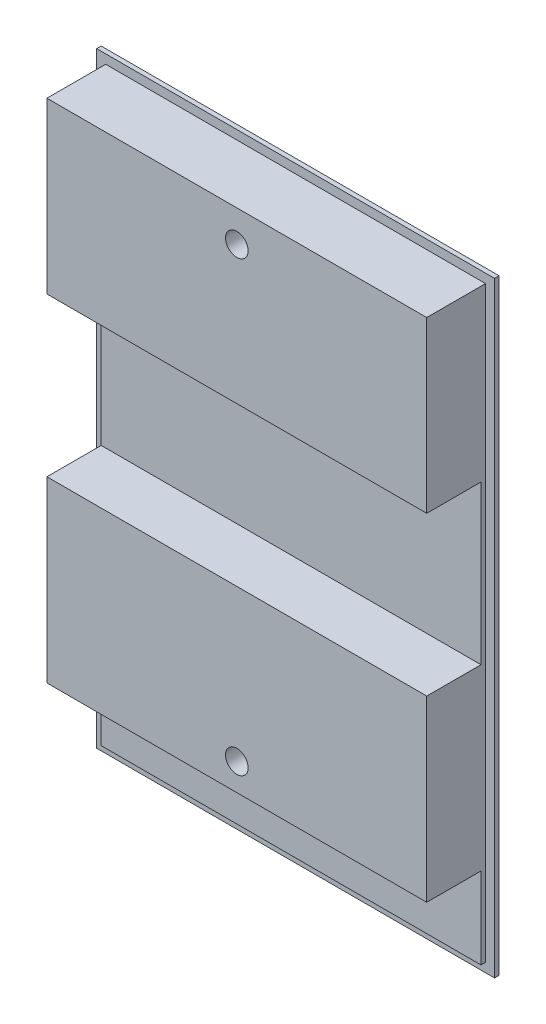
ISO-10303-21;
HEADER;
FILE_DESCRIPTION(('STEP AP214'),'2;1');
FILE_NAME('part.step','',(''),(''),'','','');
FILE_SCHEMA(('AUTOMOTIVE_DESIGN { 1 0 10303 214 1 1 1 1 }'));
ENDSEC;
DATA;
#1=APPLICATION_CONTEXT('core data for automotive mechanical design processes');
#2=APPLICATION_PROTOCOL_DEFINITION('international standard','automotive_design',2000,#1);
#3=PRODUCT_CONTEXT('',#1,'mechanical');
#4=PRODUCT('Part','Part','',(#3));
#5=PRODUCT_RELATED_PRODUCT_CATEGORY('part','',(#4));
#6=PRODUCT_DEFINITION_FORMATION('','',#4);
#7=PRODUCT_DEFINITION_CONTEXT('part definition',#1,'design');
#8=PRODUCT_DEFINITION('design','',#6,#7);
#9=PRODUCT_DEFINITION_SHAPE('','',#8);
#10=(LENGTH_UNIT() NAMED_UNIT(*) SI_UNIT(.MILLI.,.METRE.));
#11=(NAMED_UNIT(*) PLANE_ANGLE_UNIT() SI_UNIT($,.RADIAN.));
#12=(NAMED_UNIT(*) SI_UNIT($,.STERADIAN.) SOLID_ANGLE_UNIT());
#13=UNCERTAINTY_MEASURE_WITH_UNIT(LENGTH_MEASURE(1.E-05),#10,'distance_accuracy_value','');
#14=(GEOMETRIC_REPRESENTATION_CONTEXT(3) GLOBAL_UNCERTAINTY_ASSIGNED_CONTEXT((#13)) GLOBAL_UNIT_ASSIGNED_CONTEXT((#10,
#11,#12)) REPRESENTATION_CONTEXT('',''));
#15=CARTESIAN_POINT('',(0.,0.,0.));
#16=DIRECTION('',(0.,0.,1.));
#17=DIRECTION('',(1.,0.,0.));
#18=AXIS2_PLACEMENT_3D('',#15,#16,#17);
#19=CARTESIAN_POINT('',(0.,0.,2.));
#20=DIRECTION('',(0.,0.,-1.));
#21=DIRECTION('',(-1.,0.,0.));
#22=AXIS2_PLACEMENT_3D('',#19,#20,#21);
#23=PLANE('',#22);
#24=DIRECTION('',(1.,0.,0.));
#25=VECTOR('',#24,1.);
#26=CARTESIAN_POINT('',(0.,-47.,2.));
#27=LINE('',#26,#25);
#28=CARTESIAN_POINT('',(-42.,-47.,2.));
#29=VERTEX_POINT('',#28);
#30=CARTESIAN_POINT('',(42.,-47.,2.));
#31=VERTEX_POINT('',#30);
#32=EDGE_CURVE('E195',#29,#31,#27,.T.);
#33=ORIENTED_EDGE('',*,*,#32,.F.);
#34=DIRECTION('',(0.,-1.,0.));
#35=VECTOR('',#34,1.);
#36=CARTESIAN_POINT('',(-42.,-65.,2.));
#37=LINE('',#36,#35);
#38=CARTESIAN_POINT('',(-42.,-65.,2.));
#39=VERTEX_POINT('',#38);
#40=EDGE_CURVE('E252',#29,#39,#37,.T.);
#41=ORIENTED_EDGE('',*,*,#40,.T.);
#42=DIRECTION('',(1.,0.,0.));
#43=VECTOR('',#42,1.);
#44=CARTESIAN_POINT('',(-42.,-65.,2.));
#45=LINE('',#44,#43);
#46=CARTESIAN_POINT('',(42.,-65.,2.));
#47=VERTEX_POINT('',#46);
#48=EDGE_CURVE('E255',#39,#47,#45,.T.);
#49=ORIENTED_EDGE('',*,*,#48,.T.);
#50=DIRECTION('',(0.,1.,0.));
#51=VECTOR('',#50,1.);
#52=CARTESIAN_POINT('',(42.,-65.,2.));
#53=LINE('',#52,#51);
#54=EDGE_CURVE('E250',#47,#31,#53,.T.);
#55=ORIENTED_EDGE('',*,*,#54,.T.);
#56=EDGE_LOOP('',(#33,#41,#49,#55));
#57=FACE_BOUND('',#56,.T.);
#58=ADVANCED_FACE('F41',(#57),#23,.F.);
#59=CARTESIAN_POINT('',(-42.,27.5,2.));
#60=VERTEX_POINT('',#59);
#61=CARTESIAN_POINT('',(-42.,-7.50000000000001,2.));
#62=VERTEX_POINT('',#61);
#63=EDGE_CURVE('E253',#60,#62,#37,.T.);
#64=ORIENTED_EDGE('',*,*,#63,.T.);
#65=DIRECTION('',(1.,0.,0.));
#66=VECTOR('',#65,1.);
#67=CARTESIAN_POINT('',(0.,-7.50000000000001,2.));
#68=LINE('',#67,#66);
#69=CARTESIAN_POINT('',(42.,-7.50000000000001,2.));
#70=VERTEX_POINT('',#69);
#71=EDGE_CURVE('E63',#62,#70,#68,.T.);
#72=ORIENTED_EDGE('',*,*,#71,.T.);
#73=CARTESIAN_POINT('',(42.,27.5,2.));
#74=VERTEX_POINT('',#73);
#75=EDGE_CURVE('E249',#70,#74,#53,.T.);
#76=ORIENTED_EDGE('',*,*,#75,.T.);
#77=DIRECTION('',(1.,0.,0.));
#78=VECTOR('',#77,1.);
#79=CARTESIAN_POINT('',(0.,27.5,2.));
#80=LINE('',#79,#78);
#81=EDGE_CURVE('E228',#60,#74,#80,.T.);
#82=ORIENTED_EDGE('',*,*,#81,.F.);
#83=EDGE_LOOP('',(#64,#72,#76,#82));
#84=FACE_BOUND('',#83,.T.);
#85=ADVANCED_FACE('F300',(#84),#23,.F.);
#86=CARTESIAN_POINT('',(42.,-65.,2.));
#87=DIRECTION('',(-1.,0.,0.));
#88=DIRECTION('',(0.,0.,1.));
#89=AXIS2_PLACEMENT_3D('',#86,#87,#88);
#90=PLANE('',#89);
#91=DIRECTION('',(0.,0.,-1.));
#92=VECTOR('',#91,1.);
#93=CARTESIAN_POINT('',(42.,-65.,2.));
#94=LINE('',#93,#92);
#95=CARTESIAN_POINT('',(42.,-65.,1.));
#96=VERTEX_POINT('',#95);
#97=EDGE_CURVE('E257',#47,#96,#94,.T.);
#98=ORIENTED_EDGE('',*,*,#97,.T.);
#99=DIRECTION('',(0.,1.,0.));
#100=VECTOR('',#99,1.);
#101=CARTESIAN_POINT('',(42.,-65.,1.));
#102=LINE('',#101,#100);
#103=CARTESIAN_POINT('',(42.,65.,1.));
#104=VERTEX_POINT('',#103);
#105=EDGE_CURVE('E56',#96,#104,#102,.T.);
#106=ORIENTED_EDGE('',*,*,#105,.T.);
#107=DIRECTION('',(0.,0.,-1.));
#108=VECTOR('',#107,1.);
#109=CARTESIAN_POINT('',(42.,65.,2.));
#110=LINE('',#109,#108);
#111=CARTESIAN_POINT('',(42.,65.,14.));
#112=VERTEX_POINT('',#111);
#113=EDGE_CURVE('E49',#112,#104,#110,.T.);
#114=ORIENTED_EDGE('',*,*,#113,.F.);
#115=DIRECTION('',(0.,1.,0.));
#116=VECTOR('',#115,1.);
#117=CARTESIAN_POINT('',(42.,0.,14.));
#118=LINE('',#117,#116);
#119=CARTESIAN_POINT('',(42.,27.5,14.));
#120=VERTEX_POINT('',#119);
#121=EDGE_CURVE('E233',#120,#112,#118,.T.);
#122=ORIENTED_EDGE('',*,*,#121,.F.);
#123=DIRECTION('',(0.,0.,-1.));
#124=VECTOR('',#123,1.);
#125=CARTESIAN_POINT('',(42.,27.5,14.));
#126=LINE('',#125,#124);
#127=EDGE_CURVE('E239',#120,#74,#126,.T.);
#128=ORIENTED_EDGE('',*,*,#127,.T.);
#129=ORIENTED_EDGE('',*,*,#75,.F.);
#130=DIRECTION('',(0.,0.,-1.));
#131=VECTOR('',#130,1.);
#132=CARTESIAN_POINT('',(42.,-7.50000000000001,14.));
#133=LINE('',#132,#131);
#134=CARTESIAN_POINT('',(42.,-7.50000000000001,14.));
#135=VERTEX_POINT('',#134);
#136=EDGE_CURVE('E206',#135,#70,#133,.T.);
#137=ORIENTED_EDGE('',*,*,#136,.F.);
#138=DIRECTION('',(0.,1.,0.));
#139=VECTOR('',#138,1.);
#140=CARTESIAN_POINT('',(42.,0.,14.));
#141=LINE('',#140,#139);
#142=CARTESIAN_POINT('',(42.,-47.,14.));
#143=VERTEX_POINT('',#142);
#144=EDGE_CURVE('E204',#143,#135,#141,.T.);
#145=ORIENTED_EDGE('',*,*,#144,.F.);
#146=DIRECTION('',(0.,0.,-1.));
#147=VECTOR('',#146,1.);
#148=CARTESIAN_POINT('',(42.,-47.,14.));
#149=LINE('',#148,#147);
#150=EDGE_CURVE('E214',#143,#31,#149,.T.);
#151=ORIENTED_EDGE('',*,*,#150,.T.);
#152=ORIENTED_EDGE('',*,*,#54,.F.);
#153=EDGE_LOOP('',(#98,#106,#114,#122,#128,#129,#137,#145,#151,#152));
#154=FACE_BOUND('',#153,.T.);
#155=ADVANCED_FACE('F43',(#154),#90,.F.);
#156=CARTESIAN_POINT('',(-42.,65.,2.));
#157=DIRECTION('',(0.,-1.,0.));
#158=DIRECTION('',(0.,0.,-1.));
#159=AXIS2_PLACEMENT_3D('',#156,#157,#158);
#160=PLANE('',#159);
#161=ORIENTED_EDGE('',*,*,#113,.T.);
#162=DIRECTION('',(-1.,0.,0.));
#163=VECTOR('',#162,1.);
#164=CARTESIAN_POINT('',(-42.,65.,1.));
#165=LINE('',#164,#163);
#166=CARTESIAN_POINT('',(-42.,65.,1.));
#167=VERTEX_POINT('',#166);
#168=EDGE_CURVE('E186',#104,#167,#165,.T.);
#169=ORIENTED_EDGE('',*,*,#168,.T.);
#170=DIRECTION('',(0.,0.,-1.));
#171=VECTOR('',#170,1.);
#172=CARTESIAN_POINT('',(-42.,65.,2.));
#173=LINE('',#172,#171);
#174=CARTESIAN_POINT('',(-42.,65.,14.));
#175=VERTEX_POINT('',#174);
#176=EDGE_CURVE('E263',#175,#167,#173,.T.);
#177=ORIENTED_EDGE('',*,*,#176,.F.);
#178=DIRECTION('',(-1.,0.,0.));
#179=VECTOR('',#178,1.);
#180=CARTESIAN_POINT('',(0.,65.,14.));
#181=LINE('',#180,#179);
#182=EDGE_CURVE('E236',#112,#175,#181,.T.);
#183=ORIENTED_EDGE('',*,*,#182,.F.);
#184=EDGE_LOOP('',(#161,#169,#177,#183));
#185=FACE_BOUND('',#184,.T.);
#186=ADVANCED_FACE('F268',(#185),#160,.F.);
#187=CARTESIAN_POINT('',(-42.,-65.,2.));
#188=DIRECTION('',(1.,0.,0.));
#189=DIRECTION('',(0.,0.,-1.));
#190=AXIS2_PLACEMENT_3D('',#187,#188,#189);
#191=PLANE('',#190);
#192=ORIENTED_EDGE('',*,*,#176,.T.);
#193=DIRECTION('',(0.,-1.,0.));
#194=VECTOR('',#193,1.);
#195=CARTESIAN_POINT('',(-42.,-65.,1.));
#196=LINE('',#195,#194);
#197=CARTESIAN_POINT('',(-42.,-65.,1.));
#198=VERTEX_POINT('',#197);
#199=EDGE_CURVE('E180',#167,#198,#196,.T.);
#200=ORIENTED_EDGE('',*,*,#199,.T.);
#201=DIRECTION('',(0.,0.,-1.));
#202=VECTOR('',#201,1.);
#203=CARTESIAN_POINT('',(-42.,-65.,2.));
#204=LINE('',#203,#202);
#205=EDGE_CURVE('E260',#39,#198,#204,.T.);
#206=ORIENTED_EDGE('',*,*,#205,.F.);
#207=ORIENTED_EDGE('',*,*,#40,.F.);
#208=DIRECTION('',(0.,0.,-1.));
#209=VECTOR('',#208,1.);
#210=CARTESIAN_POINT('',(-42.,-47.,14.));
#211=LINE('',#210,#209);
#212=CARTESIAN_POINT('',(-42.,-47.,14.));
#213=VERTEX_POINT('',#212);
#214=EDGE_CURVE('E217',#213,#29,#211,.T.);
#215=ORIENTED_EDGE('',*,*,#214,.F.);
#216=DIRECTION('',(0.,-1.,0.));
#217=VECTOR('',#216,1.);
#218=CARTESIAN_POINT('',(-42.,0.,14.));
#219=LINE('',#218,#217);
#220=CARTESIAN_POINT('',(-42.,-7.50000000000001,14.));
#221=VERTEX_POINT('',#220);
#222=EDGE_CURVE('E198',#221,#213,#219,.T.);
#223=ORIENTED_EDGE('',*,*,#222,.F.);
#224=DIRECTION('',(0.,0.,-1.));
#225=VECTOR('',#224,1.);
#226=CARTESIAN_POINT('',(-42.,-7.50000000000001,14.));
#227=LINE('',#226,#225);
#228=EDGE_CURVE('E220',#221,#62,#227,.T.);
#229=ORIENTED_EDGE('',*,*,#228,.T.);
#230=ORIENTED_EDGE('',*,*,#63,.F.);
#231=DIRECTION('',(0.,0.,-1.));
#232=VECTOR('',#231,1.);
#233=CARTESIAN_POINT('',(-42.,27.5,14.));
#234=LINE('',#233,#232);
#235=CARTESIAN_POINT('',(-42.,27.5,14.));
#236=VERTEX_POINT('',#235);
#237=EDGE_CURVE('E246',#236,#60,#234,.T.);
#238=ORIENTED_EDGE('',*,*,#237,.F.);
#239=DIRECTION('',(0.,-1.,0.));
#240=VECTOR('',#239,1.);
#241=CARTESIAN_POINT('',(-42.,0.,14.));
#242=LINE('',#241,#240);
#243=EDGE_CURVE('E227',#175,#236,#242,.T.);
#244=ORIENTED_EDGE('',*,*,#243,.F.);
#245=EDGE_LOOP('',(#192,#200,#206,#207,#215,#223,#229,#230,#238,#244));
#246=FACE_BOUND('',#245,.T.);
#247=ADVANCED_FACE('F298',(#246),#191,.F.);
#248=CARTESIAN_POINT('',(-42.,-65.,2.));
#249=DIRECTION('',(0.,1.,0.));
#250=DIRECTION('',(0.,0.,1.));
#251=AXIS2_PLACEMENT_3D('',#248,#249,#250);
#252=PLANE('',#251);
#253=ORIENTED_EDGE('',*,*,#205,.T.);
#254=DIRECTION('',(1.,0.,0.));
#255=VECTOR('',#254,1.);
#256=CARTESIAN_POINT('',(-42.,-65.,1.));
#257=LINE('',#256,#255);
#258=EDGE_CURVE('E11',#198,#96,#257,.T.);
#259=ORIENTED_EDGE('',*,*,#258,.T.);
#260=ORIENTED_EDGE('',*,*,#97,.F.);
#261=ORIENTED_EDGE('',*,*,#48,.F.);
#262=EDGE_LOOP('',(#253,#259,#260,#261));
#263=FACE_BOUND('',#262,.T.);
#264=ADVANCED_FACE('F296',(#263),#252,.F.);
#265=CARTESIAN_POINT('',(0.,27.5,14.));
#266=DIRECTION('',(0.,1.,0.));
#267=DIRECTION('',(0.,0.,1.));
#268=AXIS2_PLACEMENT_3D('',#265,#266,#267);
#269=PLANE('',#268);
#270=ORIENTED_EDGE('',*,*,#81,.T.);
#271=ORIENTED_EDGE('',*,*,#127,.F.);
#272=DIRECTION('',(1.,0.,0.));
#273=VECTOR('',#272,1.);
#274=CARTESIAN_POINT('',(0.,27.5,14.));
#275=LINE('',#274,#273);
#276=EDGE_CURVE('E231',#236,#120,#275,.T.);
#277=ORIENTED_EDGE('',*,*,#276,.F.);
#278=ORIENTED_EDGE('',*,*,#237,.T.);
#279=EDGE_LOOP('',(#270,#271,#277,#278));
#280=FACE_BOUND('',#279,.T.);
#281=ADVANCED_FACE('F277',(#280),#269,.F.);
#282=CARTESIAN_POINT('',(0.,58.,14.));
#283=DIRECTION('',(0.,0.,-1.));
#284=DIRECTION('',(-1.,0.,0.));
#285=AXIS2_PLACEMENT_3D('',#282,#283,#284);
#286=CYLINDRICAL_SURFACE('',#285,2.5);
#287=CARTESIAN_POINT('',(0.,58.,14.));
#288=DIRECTION('',(0.,0.,1.));
#289=DIRECTION('',(1.,0.,0.));
#290=AXIS2_PLACEMENT_3D('',#287,#288,#289);
#291=CIRCLE('',#290,2.5);
#292=CARTESIAN_POINT('',(2.5,58.,14.));
#293=VERTEX_POINT('',#292);
#294=EDGE_CURVE('E224',#293,#293,#291,.T.);
#295=ORIENTED_EDGE('',*,*,#294,.T.);
#296=EDGE_LOOP('',(#295));
#297=FACE_BOUND('',#296,.T.);
#298=CARTESIAN_POINT('',(0.,58.,2.));
#299=DIRECTION('',(0.,0.,1.));
#300=DIRECTION('',(1.,0.,0.));
#301=AXIS2_PLACEMENT_3D('',#298,#299,#300);
#302=CIRCLE('',#301,2.5);
#303=CARTESIAN_POINT('',(2.5,58.,2.));
#304=VERTEX_POINT('',#303);
#305=EDGE_CURVE('E223',#304,#304,#302,.T.);
#306=ORIENTED_EDGE('',*,*,#305,.F.);
#307=EDGE_LOOP('',(#306));
#308=FACE_BOUND('',#307,.T.);
#309=ADVANCED_FACE('F328',(#297,#308),#286,.F.);
#310=CARTESIAN_POINT('',(0.,0.,14.));
#311=DIRECTION('',(0.,0.,1.));
#312=DIRECTION('',(1.,0.,0.));
#313=AXIS2_PLACEMENT_3D('',#310,#311,#312);
#314=PLANE('',#313);
#315=ORIENTED_EDGE('',*,*,#294,.F.);
#316=EDGE_LOOP('',(#315));
#317=FACE_BOUND('',#316,.T.);
#318=ORIENTED_EDGE('',*,*,#243,.T.);
#319=ORIENTED_EDGE('',*,*,#276,.T.);
#320=ORIENTED_EDGE('',*,*,#121,.T.);
#321=ORIENTED_EDGE('',*,*,#182,.T.);
#322=EDGE_LOOP('',(#318,#319,#320,#321));
#323=FACE_BOUND('',#322,.T.);
#324=ADVANCED_FACE('F272',(#317,#323),#314,.T.);
#325=ORIENTED_EDGE('',*,*,#305,.T.);
#326=EDGE_LOOP('',(#325));
#327=FACE_BOUND('',#326,.T.);
#328=ADVANCED_FACE('F308',(#327),#23,.F.);
#329=CARTESIAN_POINT('',(0.,-7.50000000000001,14.));
#330=DIRECTION('',(0.,1.,0.));
#331=DIRECTION('',(0.,0.,1.));
#332=AXIS2_PLACEMENT_3D('',#329,#330,#331);
#333=PLANE('',#332);
#334=ORIENTED_EDGE('',*,*,#71,.F.);
#335=ORIENTED_EDGE('',*,*,#228,.F.);
#336=DIRECTION('',(1.,0.,0.));
#337=VECTOR('',#336,1.);
#338=CARTESIAN_POINT('',(0.,-7.50000000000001,14.));
#339=LINE('',#338,#337);
#340=EDGE_CURVE('E194',#221,#135,#339,.T.);
#341=ORIENTED_EDGE('',*,*,#340,.T.);
#342=ORIENTED_EDGE('',*,*,#136,.T.);
#343=EDGE_LOOP('',(#334,#335,#341,#342));
#344=FACE_BOUND('',#343,.T.);
#345=ADVANCED_FACE('F280',(#344),#333,.T.);
#346=CARTESIAN_POINT('',(0.,-47.,14.));
#347=DIRECTION('',(0.,1.,0.));
#348=DIRECTION('',(0.,0.,1.));
#349=AXIS2_PLACEMENT_3D('',#346,#347,#348);
#350=PLANE('',#349);
#351=ORIENTED_EDGE('',*,*,#32,.T.);
#352=ORIENTED_EDGE('',*,*,#150,.F.);
#353=DIRECTION('',(1.,0.,0.));
#354=VECTOR('',#353,1.);
#355=CARTESIAN_POINT('',(0.,-47.,14.));
#356=LINE('',#355,#354);
#357=EDGE_CURVE('E201',#213,#143,#356,.T.);
#358=ORIENTED_EDGE('',*,*,#357,.F.);
#359=ORIENTED_EDGE('',*,*,#214,.T.);
#360=EDGE_LOOP('',(#351,#352,#358,#359));
#361=FACE_BOUND('',#360,.T.);
#362=ADVANCED_FACE('F290',(#361),#350,.F.);
#363=CARTESIAN_POINT('',(0.,-41.,14.));
#364=DIRECTION('',(0.,0.,-1.));
#365=DIRECTION('',(-1.,0.,0.));
#366=AXIS2_PLACEMENT_3D('',#363,#364,#365);
#367=CYLINDRICAL_SURFACE('',#366,2.5);
#368=CARTESIAN_POINT('',(0.,-41.,14.));
#369=DIRECTION('',(0.,0.,1.));
#370=DIRECTION('',(1.,0.,0.));
#371=AXIS2_PLACEMENT_3D('',#368,#369,#370);
#372=CIRCLE('',#371,2.5);
#373=CARTESIAN_POINT('',(2.50000000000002,-41.,14.));
#374=VERTEX_POINT('',#373);
#375=EDGE_CURVE('E191',#374,#374,#372,.T.);
#376=ORIENTED_EDGE('',*,*,#375,.T.);
#377=EDGE_LOOP('',(#376));
#378=FACE_BOUND('',#377,.T.);
#379=CARTESIAN_POINT('',(0.,-41.,2.));
#380=DIRECTION('',(0.,0.,1.));
#381=DIRECTION('',(1.,0.,0.));
#382=AXIS2_PLACEMENT_3D('',#379,#380,#381);
#383=CIRCLE('',#382,2.5);
#384=CARTESIAN_POINT('',(2.50000000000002,-41.,2.));
#385=VERTEX_POINT('',#384);
#386=EDGE_CURVE('E190',#385,#385,#383,.T.);
#387=ORIENTED_EDGE('',*,*,#386,.F.);
#388=EDGE_LOOP('',(#387));
#389=FACE_BOUND('',#388,.T.);
#390=ADVANCED_FACE('F318',(#378,#389),#367,.F.);
#391=CARTESIAN_POINT('',(0.,0.,14.));
#392=DIRECTION('',(0.,0.,1.));
#393=DIRECTION('',(1.,0.,0.));
#394=AXIS2_PLACEMENT_3D('',#391,#392,#393);
#395=PLANE('',#394);
#396=ORIENTED_EDGE('',*,*,#375,.F.);
#397=EDGE_LOOP('',(#396));
#398=FACE_BOUND('',#397,.T.);
#399=ORIENTED_EDGE('',*,*,#340,.F.);
#400=ORIENTED_EDGE('',*,*,#222,.T.);
#401=ORIENTED_EDGE('',*,*,#357,.T.);
#402=ORIENTED_EDGE('',*,*,#144,.T.);
#403=EDGE_LOOP('',(#399,#400,#401,#402));
#404=FACE_BOUND('',#403,.T.);
#405=ADVANCED_FACE('F284',(#398,#404),#395,.T.);
#406=ORIENTED_EDGE('',*,*,#386,.T.);
#407=EDGE_LOOP('',(#406));
#408=FACE_BOUND('',#407,.T.);
#409=ADVANCED_FACE('F303',(#408),#23,.F.);
#410=CARTESIAN_POINT('',(0.,0.,1.));
#411=DIRECTION('',(0.,0.,1.));
#412=DIRECTION('',(1.,0.,0.));
#413=AXIS2_PLACEMENT_3D('',#410,#411,#412);
#414=PLANE('',#413);
#415=DIRECTION('',(0.,1.,0.));
#416=VECTOR('',#415,1.);
#417=CARTESIAN_POINT('',(-44.,-67.,1.));
#418=LINE('',#417,#416);
#419=CARTESIAN_POINT('',(-44.,-67.,1.));
#420=VERTEX_POINT('',#419);
#421=CARTESIAN_POINT('',(-44.,67.,1.));
#422=VERTEX_POINT('',#421);
#423=EDGE_CURVE('E159',#420,#422,#418,.T.);
#424=ORIENTED_EDGE('',*,*,#423,.F.);
#425=DIRECTION('',(-1.,0.,0.));
#426=VECTOR('',#425,1.);
#427=CARTESIAN_POINT('',(44.,-67.,1.));
#428=LINE('',#427,#426);
#429=CARTESIAN_POINT('',(44.,-67.,1.));
#430=VERTEX_POINT('',#429);
#431=EDGE_CURVE('E152',#430,#420,#428,.T.);
#432=ORIENTED_EDGE('',*,*,#431,.F.);
#433=DIRECTION('',(0.,-1.,0.));
#434=VECTOR('',#433,1.);
#435=CARTESIAN_POINT('',(44.,-67.,1.));
#436=LINE('',#435,#434);
#437=CARTESIAN_POINT('',(44.,67.,1.));
#438=VERTEX_POINT('',#437);
#439=EDGE_CURVE('E162',#438,#430,#436,.T.);
#440=ORIENTED_EDGE('',*,*,#439,.F.);
#441=DIRECTION('',(1.,0.,0.));
#442=VECTOR('',#441,1.);
#443=CARTESIAN_POINT('',(44.,67.,1.));
#444=LINE('',#443,#442);
#445=EDGE_CURVE('E144',#422,#438,#444,.T.);
#446=ORIENTED_EDGE('',*,*,#445,.F.);
#447=EDGE_LOOP('',(#424,#432,#440,#446));
#448=FACE_BOUND('',#447,.T.);
#449=ORIENTED_EDGE('',*,*,#105,.F.);
#450=ORIENTED_EDGE('',*,*,#258,.F.);
#451=ORIENTED_EDGE('',*,*,#199,.F.);
#452=ORIENTED_EDGE('',*,*,#168,.F.);
#453=EDGE_LOOP('',(#449,#450,#451,#452));
#454=FACE_BOUND('',#453,.T.);
#455=ADVANCED_FACE('F157',(#448,#454),#414,.T.);
#456=CARTESIAN_POINT('',(-44.,-67.,1.));
#457=DIRECTION('',(-1.,0.,0.));
#458=DIRECTION('',(0.,0.,1.));
#459=AXIS2_PLACEMENT_3D('',#456,#457,#458);
#460=PLANE('',#459);
#461=DIRECTION('',(0.,1.,0.));
#462=VECTOR('',#461,1.);
#463=CARTESIAN_POINT('',(-44.,-67.,0.));
#464=LINE('',#463,#462);
#465=CARTESIAN_POINT('',(-44.,-67.,0.));
#466=VERTEX_POINT('',#465);
#467=CARTESIAN_POINT('',(-44.,67.,0.));
#468=VERTEX_POINT('',#467);
#469=EDGE_CURVE('E174',#466,#468,#464,.T.);
#470=ORIENTED_EDGE('',*,*,#469,.F.);
#471=DIRECTION('',(0.,0.,-1.));
#472=VECTOR('',#471,1.);
#473=CARTESIAN_POINT('',(-44.,-67.,1.));
#474=LINE('',#473,#472);
#475=EDGE_CURVE('E165',#420,#466,#474,.T.);
#476=ORIENTED_EDGE('',*,*,#475,.F.);
#477=ORIENTED_EDGE('',*,*,#423,.T.);
#478=DIRECTION('',(0.,0.,-1.));
#479=VECTOR('',#478,1.);
#480=CARTESIAN_POINT('',(-44.,67.,1.));
#481=LINE('',#480,#479);
#482=EDGE_CURVE('E141',#422,#468,#481,.T.);
#483=ORIENTED_EDGE('',*,*,#482,.T.);
#484=EDGE_LOOP('',(#470,#476,#477,#483));
#485=FACE_BOUND('',#484,.T.);
#486=ADVANCED_FACE('F164',(#485),#460,.T.);
#487=CARTESIAN_POINT('',(44.,-67.,1.));
#488=DIRECTION('',(0.,-1.,0.));
#489=DIRECTION('',(0.,0.,-1.));
#490=AXIS2_PLACEMENT_3D('',#487,#488,#489);
#491=PLANE('',#490);
#492=DIRECTION('',(-1.,0.,0.));
#493=VECTOR('',#492,1.);
#494=CARTESIAN_POINT('',(44.,-67.,0.));
#495=LINE('',#494,#493);
#496=CARTESIAN_POINT('',(44.,-67.,0.));
#497=VERTEX_POINT('',#496);
#498=EDGE_CURVE('E166',#497,#466,#495,.T.);
#499=ORIENTED_EDGE('',*,*,#498,.F.);
#500=DIRECTION('',(0.,0.,-1.));
#501=VECTOR('',#500,1.);
#502=CARTESIAN_POINT('',(44.,-67.,1.));
#503=LINE('',#502,#501);
#504=EDGE_CURVE('E181',#430,#497,#503,.T.);
#505=ORIENTED_EDGE('',*,*,#504,.F.);
#506=ORIENTED_EDGE('',*,*,#431,.T.);
#507=ORIENTED_EDGE('',*,*,#475,.T.);
#508=EDGE_LOOP('',(#499,#505,#506,#507));
#509=FACE_BOUND('',#508,.T.);
#510=ADVANCED_FACE('F347',(#509),#491,.T.);
#511=CARTESIAN_POINT('',(44.,-67.,1.));
#512=DIRECTION('',(1.,0.,0.));
#513=DIRECTION('',(0.,0.,-1.));
#514=AXIS2_PLACEMENT_3D('',#511,#512,#513);
#515=PLANE('',#514);
#516=DIRECTION('',(0.,-1.,0.));
#517=VECTOR('',#516,1.);
#518=CARTESIAN_POINT('',(44.,-67.,0.));
#519=LINE('',#518,#517);
#520=CARTESIAN_POINT('',(44.,67.,0.));
#521=VERTEX_POINT('',#520);
#522=EDGE_CURVE('E169',#521,#497,#519,.T.);
#523=ORIENTED_EDGE('',*,*,#522,.F.);
#524=DIRECTION('',(0.,0.,-1.));
#525=VECTOR('',#524,1.);
#526=CARTESIAN_POINT('',(44.,67.,1.));
#527=LINE('',#526,#525);
#528=EDGE_CURVE('E151',#438,#521,#527,.T.);
#529=ORIENTED_EDGE('',*,*,#528,.F.);
#530=ORIENTED_EDGE('',*,*,#439,.T.);
#531=ORIENTED_EDGE('',*,*,#504,.T.);
#532=EDGE_LOOP('',(#523,#529,#530,#531));
#533=FACE_BOUND('',#532,.T.);
#534=ADVANCED_FACE('F351',(#533),#515,.T.);
#535=CARTESIAN_POINT('',(44.,67.,1.));
#536=DIRECTION('',(0.,1.,0.));
#537=DIRECTION('',(0.,0.,1.));
#538=AXIS2_PLACEMENT_3D('',#535,#536,#537);
#539=PLANE('',#538);
#540=DIRECTION('',(1.,0.,0.));
#541=VECTOR('',#540,1.);
#542=CARTESIAN_POINT('',(44.,67.,0.));
#543=LINE('',#542,#541);
#544=EDGE_CURVE('E146',#468,#521,#543,.T.);
#545=ORIENTED_EDGE('',*,*,#544,.F.);
#546=ORIENTED_EDGE('',*,*,#482,.F.);
#547=ORIENTED_EDGE('',*,*,#445,.T.);
#548=ORIENTED_EDGE('',*,*,#528,.T.);
#549=EDGE_LOOP('',(#545,#546,#547,#548));
#550=FACE_BOUND('',#549,.T.);
#551=ADVANCED_FACE('F143',(#550),#539,.T.);
#552=CARTESIAN_POINT('',(0.,0.,0.));
#553=DIRECTION('',(0.,0.,-1.));
#554=DIRECTION('',(-1.,0.,0.));
#555=AXIS2_PLACEMENT_3D('',#552,#553,#554);
#556=PLANE('',#555);
#557=ORIENTED_EDGE('',*,*,#469,.T.);
#558=ORIENTED_EDGE('',*,*,#544,.T.);
#559=ORIENTED_EDGE('',*,*,#522,.T.);
#560=ORIENTED_EDGE('',*,*,#498,.T.);
#561=EDGE_LOOP('',(#557,#558,#559,#560));
#562=FACE_BOUND('',#561,.T.);
#563=ADVANCED_FACE('F350',(#562),#556,.T.);
#564=CLOSED_SHELL('',(#58,#85,#155,#186,#247,#264,#281,#309,#324,#328,#345,#362,#390,#405,#409,
#455,#486,#510,#534,#551,#563));
#565=MANIFOLD_SOLID_BREP('B2',#564);
#566=ADVANCED_BREP_SHAPE_REPRESENTATION('',(#18,#565),#14);
#567=SHAPE_DEFINITION_REPRESENTATION(#9,#566);
ENDSEC;
END-ISO-10303-21;
